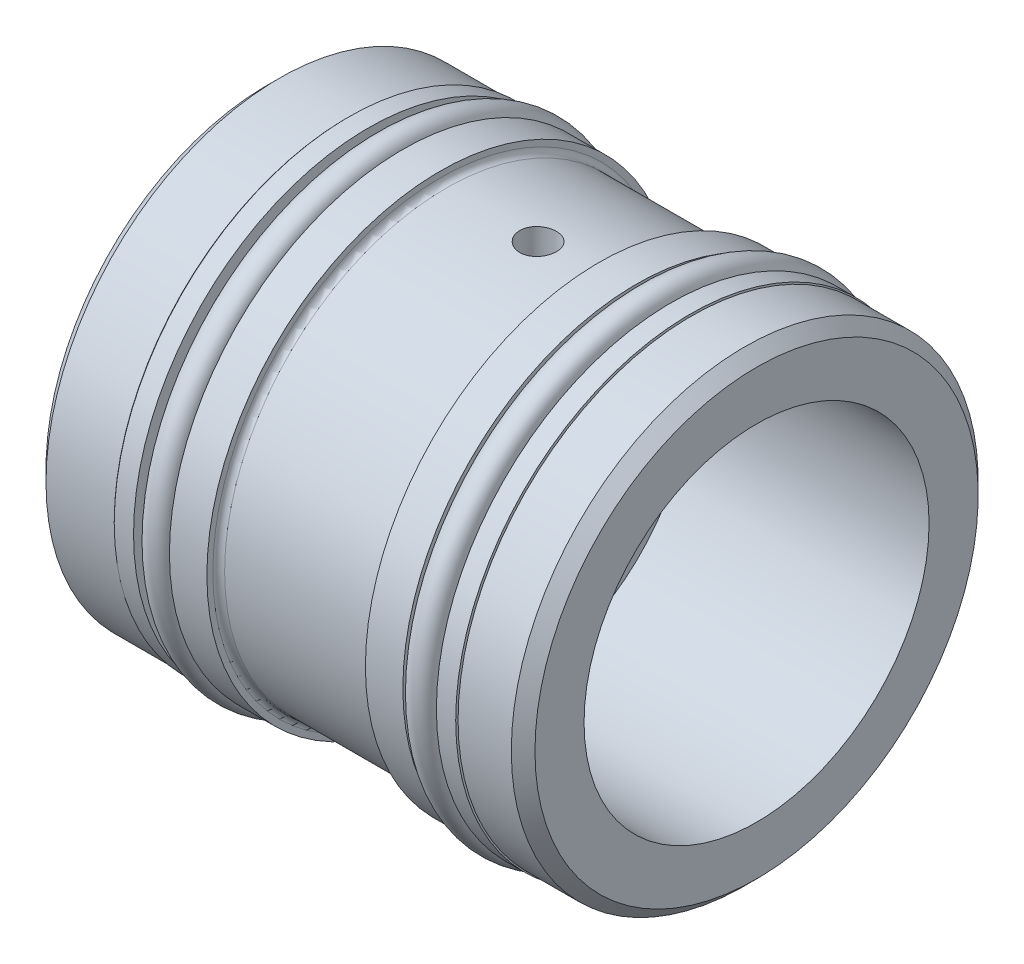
ISO-10303-21;
HEADER;
FILE_DESCRIPTION(('STEP AP214'),'2;1');
FILE_NAME('part.step','',(''),(''),'','','');
FILE_SCHEMA(('AUTOMOTIVE_DESIGN { 1 0 10303 214 1 1 1 1 }'));
ENDSEC;
DATA;
#1=APPLICATION_CONTEXT('core data for automotive mechanical design processes');
#2=APPLICATION_PROTOCOL_DEFINITION('international standard','automotive_design',2000,#1);
#3=PRODUCT_CONTEXT('',#1,'mechanical');
#4=PRODUCT('Part','Part','',(#3));
#5=PRODUCT_RELATED_PRODUCT_CATEGORY('part','',(#4));
#6=PRODUCT_DEFINITION_FORMATION('','',#4);
#7=PRODUCT_DEFINITION_CONTEXT('part definition',#1,'design');
#8=PRODUCT_DEFINITION('design','',#6,#7);
#9=PRODUCT_DEFINITION_SHAPE('','',#8);
#10=(LENGTH_UNIT() NAMED_UNIT(*) SI_UNIT(.MILLI.,.METRE.));
#11=(NAMED_UNIT(*) PLANE_ANGLE_UNIT() SI_UNIT($,.RADIAN.));
#12=(NAMED_UNIT(*) SI_UNIT($,.STERADIAN.) SOLID_ANGLE_UNIT());
#13=UNCERTAINTY_MEASURE_WITH_UNIT(LENGTH_MEASURE(1.E-05),#10,'distance_accuracy_value','');
#14=(GEOMETRIC_REPRESENTATION_CONTEXT(3) GLOBAL_UNCERTAINTY_ASSIGNED_CONTEXT((#13)) GLOBAL_UNIT_ASSIGNED_CONTEXT((#10,
#11,#12)) REPRESENTATION_CONTEXT('',''));
#15=CARTESIAN_POINT('',(0.,0.,0.));
#16=DIRECTION('',(0.,0.,1.));
#17=DIRECTION('',(1.,0.,0.));
#18=AXIS2_PLACEMENT_3D('',#15,#16,#17);
#19=CARTESIAN_POINT('',(0.,0.,0.));
#20=DIRECTION('',(-1.,0.,0.));
#21=DIRECTION('',(0.,0.,1.));
#22=AXIS2_PLACEMENT_3D('',#19,#20,#21);
#23=CYLINDRICAL_SURFACE('',#22,13.7668);
#24=CARTESIAN_POINT('',(9.32630715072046,0.,0.));
#25=DIRECTION('',(-1.,0.,0.));
#26=DIRECTION('',(0.,0.,1.));
#27=AXIS2_PLACEMENT_3D('',#24,#25,#26);
#28=CIRCLE('',#27,13.7668);
#29=CARTESIAN_POINT('',(9.32630715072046,0.,13.7668));
#30=VERTEX_POINT('',#29);
#31=EDGE_CURVE('E147',#30,#30,#28,.T.);
#32=ORIENTED_EDGE('',*,*,#31,.F.);
#33=EDGE_LOOP('',(#32));
#34=FACE_BOUND('',#33,.T.);
#35=CARTESIAN_POINT('',(10.2362,0.,0.));
#36=DIRECTION('',(1.,0.,0.));
#37=DIRECTION('',(0.,0.,-1.));
#38=AXIS2_PLACEMENT_3D('',#35,#36,#37);
#39=CIRCLE('',#38,13.7668);
#40=CARTESIAN_POINT('',(10.2362,0.,-13.7668));
#41=VERTEX_POINT('',#40);
#42=EDGE_CURVE('E10',#41,#41,#39,.T.);
#43=ORIENTED_EDGE('',*,*,#42,.F.);
#44=EDGE_LOOP('',(#43));
#45=FACE_BOUND('',#44,.T.);
#46=ADVANCED_FACE('F32',(#34,#45),#23,.T.);
#47=CARTESIAN_POINT('',(11.557,0.,0.));
#48=DIRECTION('',(-1.,0.,0.));
#49=DIRECTION('',(0.,0.,1.));
#50=AXIS2_PLACEMENT_3D('',#47,#48,#49);
#51=CIRCLE('',#50,13.7668);
#52=CARTESIAN_POINT('',(11.557,0.,13.7668));
#53=VERTEX_POINT('',#52);
#54=EDGE_CURVE('E199',#53,#53,#51,.T.);
#55=ORIENTED_EDGE('',*,*,#54,.T.);
#56=EDGE_LOOP('',(#55));
#57=FACE_BOUND('',#56,.T.);
#58=CARTESIAN_POINT('',(11.4808,0.,0.));
#59=DIRECTION('',(-1.,0.,0.));
#60=DIRECTION('',(0.,0.,1.));
#61=AXIS2_PLACEMENT_3D('',#58,#59,#60);
#62=CIRCLE('',#61,13.7668);
#63=CARTESIAN_POINT('',(11.4808,0.,13.7668));
#64=VERTEX_POINT('',#63);
#65=EDGE_CURVE('E44',#64,#64,#62,.T.);
#66=ORIENTED_EDGE('',*,*,#65,.F.);
#67=EDGE_LOOP('',(#66));
#68=FACE_BOUND('',#67,.T.);
#69=ADVANCED_FACE('F119',(#57,#68),#23,.T.);
#70=CARTESIAN_POINT('',(8.001,0.,0.));
#71=DIRECTION('',(-1.,0.,0.));
#72=DIRECTION('',(0.,0.,1.));
#73=AXIS2_PLACEMENT_3D('',#70,#71,#72);
#74=CIRCLE('',#73,13.7668);
#75=CARTESIAN_POINT('',(8.001,0.,13.7668));
#76=VERTEX_POINT('',#75);
#77=EDGE_CURVE('E143',#76,#76,#74,.T.);
#78=ORIENTED_EDGE('',*,*,#77,.F.);
#79=EDGE_LOOP('',(#78));
#80=FACE_BOUND('',#79,.T.);
#81=CARTESIAN_POINT('',(8.60609284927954,0.,0.));
#82=DIRECTION('',(1.,0.,0.));
#83=DIRECTION('',(0.,0.,-1.));
#84=AXIS2_PLACEMENT_3D('',#81,#82,#83);
#85=CIRCLE('',#84,13.7668);
#86=CARTESIAN_POINT('',(8.60609284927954,0.,-13.7668));
#87=VERTEX_POINT('',#86);
#88=EDGE_CURVE('E49',#87,#87,#85,.T.);
#89=ORIENTED_EDGE('',*,*,#88,.F.);
#90=EDGE_LOOP('',(#89));
#91=FACE_BOUND('',#90,.T.);
#92=ADVANCED_FACE('F122',(#80,#91),#23,.T.);
#93=CARTESIAN_POINT('',(0.,0.,0.));
#94=DIRECTION('',(-1.,0.,0.));
#95=DIRECTION('',(0.,0.,1.));
#96=AXIS2_PLACEMENT_3D('',#93,#94,#95);
#97=CYLINDRICAL_SURFACE('',#96,13.7668);
#98=CARTESIAN_POINT('',(-9.271,0.,0.));
#99=DIRECTION('',(-1.,0.,0.));
#100=DIRECTION('',(0.,0.,1.));
#101=AXIS2_PLACEMENT_3D('',#98,#99,#100);
#102=CIRCLE('',#101,13.7668);
#103=CARTESIAN_POINT('',(-9.271,0.,13.7668));
#104=VERTEX_POINT('',#103);
#105=EDGE_CURVE('E160',#104,#104,#102,.T.);
#106=ORIENTED_EDGE('',*,*,#105,.F.);
#107=EDGE_LOOP('',(#106));
#108=FACE_BOUND('',#107,.T.);
#109=CARTESIAN_POINT('',(-8.36110715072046,0.,0.));
#110=DIRECTION('',(1.,0.,0.));
#111=DIRECTION('',(0.,0.,-1.));
#112=AXIS2_PLACEMENT_3D('',#109,#110,#111);
#113=CIRCLE('',#112,13.7668);
#114=CARTESIAN_POINT('',(-8.36110715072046,0.,-13.7668));
#115=VERTEX_POINT('',#114);
#116=EDGE_CURVE('E149',#115,#115,#113,.T.);
#117=ORIENTED_EDGE('',*,*,#116,.F.);
#118=EDGE_LOOP('',(#117));
#119=FACE_BOUND('',#118,.T.);
#120=ADVANCED_FACE('F132',(#108,#119),#97,.T.);
#121=CARTESIAN_POINT('',(-7.0358,0.,0.));
#122=DIRECTION('',(-1.,0.,0.));
#123=DIRECTION('',(0.,0.,1.));
#124=AXIS2_PLACEMENT_3D('',#121,#122,#123);
#125=CIRCLE('',#124,13.7668);
#126=CARTESIAN_POINT('',(-7.0358,0.,13.7668));
#127=VERTEX_POINT('',#126);
#128=EDGE_CURVE('E215',#127,#127,#125,.T.);
#129=ORIENTED_EDGE('',*,*,#128,.T.);
#130=EDGE_LOOP('',(#129));
#131=FACE_BOUND('',#130,.T.);
#132=CARTESIAN_POINT('',(-7.64089284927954,0.,0.));
#133=DIRECTION('',(-1.,0.,0.));
#134=DIRECTION('',(0.,0.,1.));
#135=AXIS2_PLACEMENT_3D('',#132,#133,#134);
#136=CIRCLE('',#135,13.7668);
#137=CARTESIAN_POINT('',(-7.64089284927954,0.,13.7668));
#138=VERTEX_POINT('',#137);
#139=EDGE_CURVE('E154',#138,#138,#136,.T.);
#140=ORIENTED_EDGE('',*,*,#139,.F.);
#141=EDGE_LOOP('',(#140));
#142=FACE_BOUND('',#141,.T.);
#143=ADVANCED_FACE('F137',(#131,#142),#97,.T.);
#144=CARTESIAN_POINT('',(-10.5918,0.,0.));
#145=DIRECTION('',(-1.,0.,0.));
#146=DIRECTION('',(0.,0.,1.));
#147=AXIS2_PLACEMENT_3D('',#144,#145,#146);
#148=CIRCLE('',#147,13.7668);
#149=CARTESIAN_POINT('',(-10.5918,0.,13.7668));
#150=VERTEX_POINT('',#149);
#151=EDGE_CURVE('E218',#150,#150,#148,.T.);
#152=ORIENTED_EDGE('',*,*,#151,.F.);
#153=EDGE_LOOP('',(#152));
#154=FACE_BOUND('',#153,.T.);
#155=CARTESIAN_POINT('',(-10.5156,0.,0.));
#156=DIRECTION('',(1.,0.,0.));
#157=DIRECTION('',(0.,0.,-1.));
#158=AXIS2_PLACEMENT_3D('',#155,#156,#157);
#159=CIRCLE('',#158,13.7668);
#160=CARTESIAN_POINT('',(-10.5156,0.,-13.7668));
#161=VERTEX_POINT('',#160);
#162=EDGE_CURVE('E157',#161,#161,#159,.T.);
#163=ORIENTED_EDGE('',*,*,#162,.F.);
#164=EDGE_LOOP('',(#163));
#165=FACE_BOUND('',#164,.T.);
#166=ADVANCED_FACE('F98',(#154,#165),#97,.T.);
#167=CARTESIAN_POINT('',(0.,0.,0.));
#168=DIRECTION('',(-1.,0.,0.));
#169=DIRECTION('',(0.,0.,1.));
#170=AXIS2_PLACEMENT_3D('',#167,#168,#169);
#171=CYLINDRICAL_SURFACE('',#170,6.35);
#172=CARTESIAN_POINT('',(0.355599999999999,0.,0.));
#173=DIRECTION('',(-1.,0.,0.));
#174=DIRECTION('',(0.,0.,1.));
#175=AXIS2_PLACEMENT_3D('',#172,#173,#174);
#176=CIRCLE('',#175,6.35);
#177=CARTESIAN_POINT('',(0.355599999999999,0.,6.35));
#178=VERTEX_POINT('',#177);
#179=EDGE_CURVE('E187',#178,#178,#176,.T.);
#180=ORIENTED_EDGE('',*,*,#179,.F.);
#181=EDGE_LOOP('',(#180));
#182=FACE_BOUND('',#181,.T.);
#183=CARTESIAN_POINT('',(-15.748,0.,0.));
#184=DIRECTION('',(-1.,0.,0.));
#185=DIRECTION('',(0.,0.,1.));
#186=AXIS2_PLACEMENT_3D('',#183,#184,#185);
#187=CIRCLE('',#186,6.35);
#188=CARTESIAN_POINT('',(-15.748,0.,6.35));
#189=VERTEX_POINT('',#188);
#190=EDGE_CURVE('E224',#189,#189,#187,.T.);
#191=ORIENTED_EDGE('',*,*,#190,.T.);
#192=EDGE_LOOP('',(#191));
#193=FACE_BOUND('',#192,.T.);
#194=ADVANCED_FACE('F94',(#182,#193),#171,.F.);
#195=CARTESIAN_POINT('',(0.355599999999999,6.35,0.));
#196=DIRECTION('',(-1.,0.,0.));
#197=DIRECTION('',(0.,0.,1.));
#198=AXIS2_PLACEMENT_3D('',#195,#196,#197);
#199=PLANE('',#198);
#200=CARTESIAN_POINT('',(0.355599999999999,0.,0.));
#201=DIRECTION('',(-1.,0.,0.));
#202=DIRECTION('',(0.,0.,1.));
#203=AXIS2_PLACEMENT_3D('',#200,#201,#202);
#204=CIRCLE('',#203,11.1125);
#205=CARTESIAN_POINT('',(0.355599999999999,0.,11.1125));
#206=VERTEX_POINT('',#205);
#207=EDGE_CURVE('E190',#206,#206,#204,.T.);
#208=ORIENTED_EDGE('',*,*,#207,.F.);
#209=EDGE_LOOP('',(#208));
#210=FACE_BOUND('',#209,.T.);
#211=ORIENTED_EDGE('',*,*,#179,.T.);
#212=EDGE_LOOP('',(#211));
#213=FACE_BOUND('',#212,.T.);
#214=ADVANCED_FACE('F88',(#210,#213),#199,.F.);
#215=CARTESIAN_POINT('',(0.,0.,0.));
#216=DIRECTION('',(-1.,0.,0.));
#217=DIRECTION('',(0.,0.,1.));
#218=AXIS2_PLACEMENT_3D('',#215,#216,#217);
#219=CYLINDRICAL_SURFACE('',#218,11.1125);
#220=CARTESIAN_POINT('',(1.6764,-11.0495546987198,1.1811));
#221=CARTESIAN_POINT('',(1.61025843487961,-11.0495555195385,1.18109714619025));
#222=CARTESIAN_POINT('',(1.5440736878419,-11.0501549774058,1.17552539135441));
#223=CARTESIAN_POINT('',(1.4135407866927,-11.0524875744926,1.15338363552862));
#224=CARTESIAN_POINT('',(1.34919471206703,-11.054221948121,1.13680165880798));
#225=CARTESIAN_POINT('',(1.22424827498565,-11.0586257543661,1.09312916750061));
#226=CARTESIAN_POINT('',(1.16364560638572,-11.0612946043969,1.06604519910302));
#227=CARTESIAN_POINT('',(1.04785884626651,-11.0672659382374,1.00215046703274));
#228=CARTESIAN_POINT('',(0.992673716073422,-11.0705683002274,0.965341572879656));
#229=CARTESIAN_POINT('',(0.889050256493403,-11.0774496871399,0.882880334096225));
#230=CARTESIAN_POINT('',(0.840637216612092,-11.0810296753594,0.837196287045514));
#231=CARTESIAN_POINT('',(0.752150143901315,-11.0880542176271,0.73834944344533));
#232=CARTESIAN_POINT('',(0.712076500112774,-11.0914987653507,0.685186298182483));
#233=CARTESIAN_POINT('',(0.641317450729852,-11.097873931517,0.57273433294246));
#234=CARTESIAN_POINT('',(0.610654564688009,-11.1008033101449,0.5134312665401));
#235=CARTESIAN_POINT('',(0.559731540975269,-11.105807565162,0.39048157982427));
#236=CARTESIAN_POINT('',(0.53947111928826,-11.1078824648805,0.326835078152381));
#237=CARTESIAN_POINT('',(0.510002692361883,-11.1109372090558,0.197261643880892));
#238=CARTESIAN_POINT('',(0.500753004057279,-11.1119211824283,0.131344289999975));
#239=CARTESIAN_POINT('',(0.493439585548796,-11.11269726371,-0.00111401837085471));
#240=CARTESIAN_POINT('',(0.495375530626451,-11.1124894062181,-0.0676549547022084));
#241=CARTESIAN_POINT('',(0.510344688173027,-11.1109086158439,-0.199188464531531));
#242=CARTESIAN_POINT('',(0.523333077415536,-11.1095403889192,-0.264186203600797));
#243=CARTESIAN_POINT('',(0.559968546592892,-11.1057979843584,-0.391074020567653));
#244=CARTESIAN_POINT('',(0.583615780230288,-11.1034237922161,-0.45296405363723));
#245=CARTESIAN_POINT('',(0.640946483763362,-11.0979282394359,-0.572020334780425));
#246=CARTESIAN_POINT('',(0.674649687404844,-11.0948054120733,-0.629177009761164));
#247=CARTESIAN_POINT('',(0.751121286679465,-11.088162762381,-0.73703965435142));
#248=CARTESIAN_POINT('',(0.793889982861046,-11.0846429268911,-0.787745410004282));
#249=CARTESIAN_POINT('',(0.887530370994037,-11.0775804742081,-0.881529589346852));
#250=CARTESIAN_POINT('',(0.938441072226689,-11.0740378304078,-0.924569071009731));
#251=CARTESIAN_POINT('',(1.04678534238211,-11.0673463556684,-1.00149721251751));
#252=CARTESIAN_POINT('',(1.10421892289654,-11.0641975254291,-1.0353858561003));
#253=CARTESIAN_POINT('',(1.22400964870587,-11.0586500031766,-1.09305071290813));
#254=CARTESIAN_POINT('',(1.28636804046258,-11.0562515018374,-1.11682435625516));
#255=CARTESIAN_POINT('',(1.41422273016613,-11.0524801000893,-1.15355269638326));
#256=CARTESIAN_POINT('',(1.479718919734,-11.0511071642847,-1.16650776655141));
#257=CARTESIAN_POINT('',(1.61164766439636,-11.0495485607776,-1.1811807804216));
#258=CARTESIAN_POINT('',(1.67807408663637,-11.049357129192,-1.1829532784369));
#259=CARTESIAN_POINT('',(1.81027809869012,-11.0501679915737,-1.17535425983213));
#260=CARTESIAN_POINT('',(1.87605569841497,-11.0511702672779,-1.16598291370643));
#261=CARTESIAN_POINT('',(2.00493483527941,-11.0542503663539,-1.13640793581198));
#262=CARTESIAN_POINT('',(2.0680423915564,-11.0563256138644,-1.11623024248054));
#263=CARTESIAN_POINT('',(2.18997742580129,-11.0613157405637,-1.0656418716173));
#264=CARTESIAN_POINT('',(2.248804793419,-11.0642306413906,-1.03523093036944));
#265=CARTESIAN_POINT('',(2.36075779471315,-11.07058556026,-0.964903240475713));
#266=CARTESIAN_POINT('',(2.41386065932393,-11.0740275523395,-0.924950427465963));
#267=CARTESIAN_POINT('',(2.51262603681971,-11.0810424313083,-0.836724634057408));
#268=CARTESIAN_POINT('',(2.55828834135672,-11.0846153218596,-0.788451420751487));
#269=CARTESIAN_POINT('',(2.64106535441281,-11.091506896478,-0.684718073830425));
#270=CARTESIAN_POINT('',(2.67814441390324,-11.0948244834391,-0.629229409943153));
#271=CARTESIAN_POINT('',(2.74245677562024,-11.1008155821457,-0.512780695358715));
#272=CARTESIAN_POINT('',(2.7696902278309,-11.1034891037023,-0.451820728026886));
#273=CARTESIAN_POINT('',(2.81347826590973,-11.1078859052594,-0.326282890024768));
#274=CARTESIAN_POINT('',(2.83005416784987,-11.1096110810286,-0.261712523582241));
#275=CARTESIAN_POINT('',(2.8521260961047,-11.1119246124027,-0.130685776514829));
#276=CARTESIAN_POINT('',(2.8576224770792,-11.1125130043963,-0.0642294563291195));
#277=CARTESIAN_POINT('',(2.85737398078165,-11.1124866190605,0.068333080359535));
#278=CARTESIAN_POINT('',(2.85168435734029,-11.1118777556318,0.134439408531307));
#279=CARTESIAN_POINT('',(2.82934149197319,-11.1095369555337,0.264751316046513));
#280=CARTESIAN_POINT('',(2.81268824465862,-11.1078050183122,0.328956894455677));
#281=CARTESIAN_POINT('',(2.76890665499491,-11.1034120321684,0.453642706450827));
#282=CARTESIAN_POINT('',(2.7417801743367,-11.1007511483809,0.514123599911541));
#283=CARTESIAN_POINT('',(2.6778279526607,-11.0947964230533,0.62968276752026));
#284=CARTESIAN_POINT('',(2.64100222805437,-11.0915025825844,0.684761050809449));
#285=CARTESIAN_POINT('',(2.55849016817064,-11.0846311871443,0.788234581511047));
#286=CARTESIAN_POINT('',(2.51276266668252,-11.0810523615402,0.836596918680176));
#287=CARTESIAN_POINT('',(2.41382775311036,-11.0740249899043,0.924985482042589));
#288=CARTESIAN_POINT('',(2.36061855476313,-11.0705764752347,0.96500971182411));
#289=CARTESIAN_POINT('',(2.24806302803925,-11.0641897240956,1.03567775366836));
#290=CARTESIAN_POINT('',(2.18869971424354,-11.0612529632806,1.06629462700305));
#291=CARTESIAN_POINT('',(2.06568010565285,-11.0562397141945,1.11708410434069));
#292=CARTESIAN_POINT('',(2.00202870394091,-11.054162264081,1.13726839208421));
#293=CARTESIAN_POINT('',(1.89441976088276,-11.051622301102,1.16163240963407));
#294=CARTESIAN_POINT('',(1.85114823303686,-11.0508506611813,1.16892266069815));
#295=CARTESIAN_POINT('',(1.76405745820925,-11.0498165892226,1.17865738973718));
#296=CARTESIAN_POINT('',(1.7202382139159,-11.0495541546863,1.18110189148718));
#297=CARTESIAN_POINT('',(1.6764,-11.0495546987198,1.1811));
#298=B_SPLINE_CURVE_WITH_KNOTS('',3,(#220,#221,#222,#223,#224,#225,#226,#227,#228,#229,#230,
#231,#232,#233,#234,#235,#236,#237,#238,#239,#240,#241,#242,#243,#244,#245,#246,#247,#248,#249,
#250,#251,#252,#253,#254,#255,#256,#257,#258,#259,#260,#261,#262,#263,#264,#265,#266,#267,#268,
#269,#270,#271,#272,#273,#274,#275,#276,#277,#278,#279,#280,#281,#282,#283,#284,#285,#286,#287,
#288,#289,#290,#291,#292,#293,#294,#295,#296,#297),.UNSPECIFIED.,.T.,.F.,(4,2,2,2,2,2,2,2,2,2,2,
2,2,2,2,2,2,2,2,2,2,2,2,2,2,2,2,2,2,2,2,2,2,2,2,2,2,2,4),(0.,0.198264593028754,
0.396745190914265,0.595102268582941,0.793421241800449,0.99246209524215,1.19151223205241,
1.39103503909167,1.59055239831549,1.78931202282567,1.98806587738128,2.18601750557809,
2.38397198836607,2.58231751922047,2.78066962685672,2.98000221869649,3.17933516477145,
3.37871872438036,3.57809540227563,3.77649866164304,3.97489888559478,4.17282501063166,
4.37075623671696,4.5694477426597,4.76814481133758,4.96765289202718,5.16715793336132,
5.36626269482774,5.56536108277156,5.76347848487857,5.96159598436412,6.15967828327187,
6.35776024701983,6.55678098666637,6.75584932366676,6.95548250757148,7.15489162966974,
7.28630080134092,7.41770932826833),.UNSPECIFIED.);
#299=CARTESIAN_POINT('',(1.6764,-11.0495546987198,1.1811));
#300=VERTEX_POINT('',#299);
#301=EDGE_CURVE('E78',#300,#300,#298,.T.);
#302=ORIENTED_EDGE('',*,*,#301,.T.);
#303=EDGE_LOOP('',(#302));
#304=FACE_BOUND('',#303,.T.);
#305=CARTESIAN_POINT('',(1.6764,11.0495546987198,1.1811));
#306=CARTESIAN_POINT('',(1.74254156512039,11.0495555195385,1.18109714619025));
#307=CARTESIAN_POINT('',(1.80872631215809,11.0501549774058,1.17552539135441));
#308=CARTESIAN_POINT('',(1.9392592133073,11.0524875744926,1.15338363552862));
#309=CARTESIAN_POINT('',(2.00360528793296,11.054221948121,1.13680165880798));
#310=CARTESIAN_POINT('',(2.12855172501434,11.0586257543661,1.09312916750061));
#311=CARTESIAN_POINT('',(2.18915439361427,11.0612946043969,1.06604519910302));
#312=CARTESIAN_POINT('',(2.30494115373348,11.0672659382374,1.00215046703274));
#313=CARTESIAN_POINT('',(2.36012628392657,11.0705683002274,0.965341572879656));
#314=CARTESIAN_POINT('',(2.46374974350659,11.0774496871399,0.882880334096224));
#315=CARTESIAN_POINT('',(2.5121627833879,11.0810296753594,0.837196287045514));
#316=CARTESIAN_POINT('',(2.60064985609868,11.0880542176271,0.73834944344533));
#317=CARTESIAN_POINT('',(2.64072349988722,11.0914987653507,0.685186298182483));
#318=CARTESIAN_POINT('',(2.71148254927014,11.097873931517,0.57273433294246));
#319=CARTESIAN_POINT('',(2.74214543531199,11.1008033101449,0.5134312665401));
#320=CARTESIAN_POINT('',(2.79306845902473,11.105807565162,0.39048157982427));
#321=CARTESIAN_POINT('',(2.81332888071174,11.1078824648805,0.326835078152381));
#322=CARTESIAN_POINT('',(2.84279730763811,11.1109372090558,0.197261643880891));
#323=CARTESIAN_POINT('',(2.85204699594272,11.1119211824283,0.131344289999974));
#324=CARTESIAN_POINT('',(2.8593604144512,11.11269726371,-0.00111401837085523));
#325=CARTESIAN_POINT('',(2.85742446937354,11.1124894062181,-0.0676549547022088));
#326=CARTESIAN_POINT('',(2.84245531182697,11.1109086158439,-0.199188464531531));
#327=CARTESIAN_POINT('',(2.82946692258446,11.1095403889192,-0.264186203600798));
#328=CARTESIAN_POINT('',(2.7928314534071,11.1057979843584,-0.391074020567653));
#329=CARTESIAN_POINT('',(2.76918421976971,11.1034237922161,-0.452964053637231));
#330=CARTESIAN_POINT('',(2.71185351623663,11.0979282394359,-0.572020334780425));
#331=CARTESIAN_POINT('',(2.67815031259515,11.0948054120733,-0.629177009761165));
#332=CARTESIAN_POINT('',(2.60167871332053,11.088162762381,-0.737039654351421));
#333=CARTESIAN_POINT('',(2.55891001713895,11.0846429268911,-0.787745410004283));
#334=CARTESIAN_POINT('',(2.46526962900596,11.0775804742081,-0.881529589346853));
#335=CARTESIAN_POINT('',(2.41435892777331,11.0740378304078,-0.924569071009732));
#336=CARTESIAN_POINT('',(2.30601465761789,11.0673463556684,-1.00149721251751));
#337=CARTESIAN_POINT('',(2.24858107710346,11.0641975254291,-1.0353858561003));
#338=CARTESIAN_POINT('',(2.12879035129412,11.0586500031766,-1.09305071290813));
#339=CARTESIAN_POINT('',(2.06643195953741,11.0562515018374,-1.11682435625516));
#340=CARTESIAN_POINT('',(1.93857726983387,11.0524801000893,-1.15355269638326));
#341=CARTESIAN_POINT('',(1.87308108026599,11.0511071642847,-1.16650776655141));
#342=CARTESIAN_POINT('',(1.74115233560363,11.0495485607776,-1.1811807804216));
#343=CARTESIAN_POINT('',(1.67472591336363,11.049357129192,-1.1829532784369));
#344=CARTESIAN_POINT('',(1.54252190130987,11.0501679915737,-1.17535425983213));
#345=CARTESIAN_POINT('',(1.47674430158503,11.0511702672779,-1.16598291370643));
#346=CARTESIAN_POINT('',(1.34786516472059,11.0542503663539,-1.13640793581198));
#347=CARTESIAN_POINT('',(1.28475760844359,11.0563256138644,-1.11623024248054));
#348=CARTESIAN_POINT('',(1.16282257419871,11.0613157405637,-1.0656418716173));
#349=CARTESIAN_POINT('',(1.10399520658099,11.0642306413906,-1.03523093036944));
#350=CARTESIAN_POINT('',(0.992042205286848,11.07058556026,-0.964903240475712));
#351=CARTESIAN_POINT('',(0.93893934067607,11.0740275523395,-0.924950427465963));
#352=CARTESIAN_POINT('',(0.840173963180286,11.0810424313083,-0.836724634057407));
#353=CARTESIAN_POINT('',(0.794511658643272,11.0846153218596,-0.788451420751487));
#354=CARTESIAN_POINT('',(0.711734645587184,11.091506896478,-0.684718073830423));
#355=CARTESIAN_POINT('',(0.674655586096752,11.0948244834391,-0.629229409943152));
#356=CARTESIAN_POINT('',(0.610343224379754,11.1008155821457,-0.512780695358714));
#357=CARTESIAN_POINT('',(0.583109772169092,11.1034891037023,-0.451820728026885));
#358=CARTESIAN_POINT('',(0.539321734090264,11.1078859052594,-0.326282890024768));
#359=CARTESIAN_POINT('',(0.522745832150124,11.1096110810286,-0.261712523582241));
#360=CARTESIAN_POINT('',(0.500673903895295,11.1119246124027,-0.130685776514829));
#361=CARTESIAN_POINT('',(0.4951775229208,11.1125130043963,-0.0642294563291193));
#362=CARTESIAN_POINT('',(0.495426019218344,11.1124866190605,0.0683330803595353));
#363=CARTESIAN_POINT('',(0.501115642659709,11.1118777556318,0.134439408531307));
#364=CARTESIAN_POINT('',(0.523458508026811,11.1095369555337,0.264751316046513));
#365=CARTESIAN_POINT('',(0.540111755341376,11.1078050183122,0.328956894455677));
#366=CARTESIAN_POINT('',(0.583893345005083,11.1034120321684,0.453642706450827));
#367=CARTESIAN_POINT('',(0.611019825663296,11.1007511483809,0.514123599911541));
#368=CARTESIAN_POINT('',(0.674972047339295,11.0947964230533,0.629682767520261));
#369=CARTESIAN_POINT('',(0.711797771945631,11.0915025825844,0.684761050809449));
#370=CARTESIAN_POINT('',(0.794309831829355,11.0846311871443,0.788234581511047));
#371=CARTESIAN_POINT('',(0.840037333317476,11.0810523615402,0.836596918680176));
#372=CARTESIAN_POINT('',(0.938972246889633,11.0740249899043,0.924985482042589));
#373=CARTESIAN_POINT('',(0.992181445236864,11.0705764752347,0.96500971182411));
#374=CARTESIAN_POINT('',(1.10473697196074,11.0641897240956,1.03567775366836));
#375=CARTESIAN_POINT('',(1.16410028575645,11.0612529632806,1.06629462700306));
#376=CARTESIAN_POINT('',(1.28711989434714,11.0562397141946,1.11708410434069));
#377=CARTESIAN_POINT('',(1.35077129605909,11.054162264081,1.13726839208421));
#378=CARTESIAN_POINT('',(1.45838023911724,11.051622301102,1.16163240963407));
#379=CARTESIAN_POINT('',(1.50165176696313,11.0508506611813,1.16892266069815));
#380=CARTESIAN_POINT('',(1.58874254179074,11.0498165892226,1.17865738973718));
#381=CARTESIAN_POINT('',(1.6325617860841,11.0495541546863,1.18110189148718));
#382=CARTESIAN_POINT('',(1.6764,11.0495546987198,1.1811));
#383=B_SPLINE_CURVE_WITH_KNOTS('',3,(#305,#306,#307,#308,#309,#310,#311,#312,#313,#314,#315,
#316,#317,#318,#319,#320,#321,#322,#323,#324,#325,#326,#327,#328,#329,#330,#331,#332,#333,#334,
#335,#336,#337,#338,#339,#340,#341,#342,#343,#344,#345,#346,#347,#348,#349,#350,#351,#352,#353,
#354,#355,#356,#357,#358,#359,#360,#361,#362,#363,#364,#365,#366,#367,#368,#369,#370,#371,#372,
#373,#374,#375,#376,#377,#378,#379,#380,#381,#382),.UNSPECIFIED.,.T.,.F.,(4,2,2,2,2,2,2,2,2,2,2,
2,2,2,2,2,2,2,2,2,2,2,2,2,2,2,2,2,2,2,2,2,2,2,2,2,2,2,4),(0.,0.198264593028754,
0.396745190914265,0.595102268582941,0.793421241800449,0.992462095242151,1.19151223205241,
1.39103503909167,1.59055239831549,1.78931202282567,1.98806587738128,2.18601750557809,
2.38397198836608,2.58231751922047,2.78066962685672,2.98000221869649,3.17933516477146,
3.37871872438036,3.57809540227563,3.77649866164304,3.97489888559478,4.17282501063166,
4.37075623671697,4.5694477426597,4.76814481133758,4.96765289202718,5.16715793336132,
5.36626269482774,5.56536108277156,5.76347848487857,5.96159598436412,6.15967828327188,
6.35776024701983,6.55678098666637,6.75584932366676,6.95548250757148,7.15489162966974,
7.28630080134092,7.41770932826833),.UNSPECIFIED.);
#384=CARTESIAN_POINT('',(1.6764,11.0495546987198,1.1811));
#385=VERTEX_POINT('',#384);
#386=EDGE_CURVE('E73',#385,#385,#383,.T.);
#387=ORIENTED_EDGE('',*,*,#386,.T.);
#388=EDGE_LOOP('',(#387));
#389=FACE_BOUND('',#388,.T.);
#390=CARTESIAN_POINT('',(15.748,0.,0.));
#391=DIRECTION('',(-1.,0.,0.));
#392=DIRECTION('',(0.,0.,1.));
#393=AXIS2_PLACEMENT_3D('',#390,#391,#392);
#394=CIRCLE('',#393,11.1125);
#395=CARTESIAN_POINT('',(15.748,0.,11.1125));
#396=VERTEX_POINT('',#395);
#397=EDGE_CURVE('E193',#396,#396,#394,.T.);
#398=ORIENTED_EDGE('',*,*,#397,.F.);
#399=EDGE_LOOP('',(#398));
#400=FACE_BOUND('',#399,.T.);
#401=ORIENTED_EDGE('',*,*,#207,.T.);
#402=EDGE_LOOP('',(#401));
#403=FACE_BOUND('',#402,.T.);
#404=ADVANCED_FACE('F82',(#304,#389,#400,#403),#219,.F.);
#405=CARTESIAN_POINT('',(15.748,15.0368,0.));
#406=DIRECTION('',(-1.,0.,0.));
#407=DIRECTION('',(0.,0.,1.));
#408=AXIS2_PLACEMENT_3D('',#405,#406,#407);
#409=PLANE('',#408);
#410=CARTESIAN_POINT('',(15.748,0.,0.));
#411=DIRECTION('',(-1.,0.,0.));
#412=DIRECTION('',(0.,0.,1.));
#413=AXIS2_PLACEMENT_3D('',#410,#411,#412);
#414=CIRCLE('',#413,14.2748);
#415=CARTESIAN_POINT('',(15.748,0.,14.2748));
#416=VERTEX_POINT('',#415);
#417=EDGE_CURVE('E169',#416,#416,#414,.F.);
#418=ORIENTED_EDGE('',*,*,#417,.T.);
#419=EDGE_LOOP('',(#418));
#420=FACE_BOUND('',#419,.T.);
#421=ORIENTED_EDGE('',*,*,#397,.T.);
#422=EDGE_LOOP('',(#421));
#423=FACE_BOUND('',#422,.T.);
#424=ADVANCED_FACE('F87',(#420,#423),#409,.F.);
#425=CARTESIAN_POINT('',(0.,0.,0.));
#426=DIRECTION('',(-1.,0.,0.));
#427=DIRECTION('',(0.,0.,1.));
#428=AXIS2_PLACEMENT_3D('',#425,#426,#427);
#429=CYLINDRICAL_SURFACE('',#428,15.0368);
#430=CARTESIAN_POINT('',(14.986,0.,0.));
#431=DIRECTION('',(-1.,0.,0.));
#432=DIRECTION('',(0.,0.,1.));
#433=AXIS2_PLACEMENT_3D('',#430,#431,#432);
#434=CIRCLE('',#433,15.0368);
#435=CARTESIAN_POINT('',(14.986,0.,15.0368));
#436=VERTEX_POINT('',#435);
#437=EDGE_CURVE('E172',#436,#436,#434,.T.);
#438=ORIENTED_EDGE('',*,*,#437,.T.);
#439=EDGE_LOOP('',(#438));
#440=FACE_BOUND('',#439,.T.);
#441=CARTESIAN_POINT('',(11.557,0.,0.));
#442=DIRECTION('',(-1.,0.,0.));
#443=DIRECTION('',(0.,0.,1.));
#444=AXIS2_PLACEMENT_3D('',#441,#442,#443);
#445=CIRCLE('',#444,15.0368);
#446=CARTESIAN_POINT('',(11.557,0.,15.0368));
#447=VERTEX_POINT('',#446);
#448=EDGE_CURVE('E196',#447,#447,#445,.T.);
#449=ORIENTED_EDGE('',*,*,#448,.F.);
#450=EDGE_LOOP('',(#449));
#451=FACE_BOUND('',#450,.T.);
#452=ADVANCED_FACE('F419',(#440,#451),#429,.T.);
#453=CARTESIAN_POINT('',(11.557,15.0368,0.));
#454=DIRECTION('',(1.,0.,0.));
#455=DIRECTION('',(0.,0.,-1.));
#456=AXIS2_PLACEMENT_3D('',#453,#454,#455);
#457=PLANE('',#456);
#458=ORIENTED_EDGE('',*,*,#54,.F.);
#459=EDGE_LOOP('',(#458));
#460=FACE_BOUND('',#459,.T.);
#461=ORIENTED_EDGE('',*,*,#448,.T.);
#462=EDGE_LOOP('',(#461));
#463=FACE_BOUND('',#462,.T.);
#464=ADVANCED_FACE('F427',(#460,#463),#457,.F.);
#465=CARTESIAN_POINT('',(8.001,13.7668,0.));
#466=DIRECTION('',(-1.,0.,0.));
#467=DIRECTION('',(0.,0.,1.));
#468=AXIS2_PLACEMENT_3D('',#465,#466,#467);
#469=PLANE('',#468);
#470=CARTESIAN_POINT('',(8.001,0.,0.));
#471=DIRECTION('',(-1.,0.,0.));
#472=DIRECTION('',(0.,0.,1.));
#473=AXIS2_PLACEMENT_3D('',#470,#471,#472);
#474=CIRCLE('',#473,15.0368);
#475=CARTESIAN_POINT('',(8.001,0.,15.0368));
#476=VERTEX_POINT('',#475);
#477=EDGE_CURVE('E203',#476,#476,#474,.T.);
#478=ORIENTED_EDGE('',*,*,#477,.F.);
#479=EDGE_LOOP('',(#478));
#480=FACE_BOUND('',#479,.T.);
#481=ORIENTED_EDGE('',*,*,#77,.T.);
#482=EDGE_LOOP('',(#481));
#483=FACE_BOUND('',#482,.T.);
#484=ADVANCED_FACE('F434',(#480,#483),#469,.F.);
#485=CARTESIAN_POINT('',(0.,0.,0.));
#486=DIRECTION('',(-1.,0.,0.));
#487=DIRECTION('',(0.,0.,1.));
#488=AXIS2_PLACEMENT_3D('',#485,#486,#487);
#489=CYLINDRICAL_SURFACE('',#488,15.0368);
#490=CARTESIAN_POINT('',(5.588,0.,0.));
#491=DIRECTION('',(-1.,0.,0.));
#492=DIRECTION('',(0.,0.,1.));
#493=AXIS2_PLACEMENT_3D('',#490,#491,#492);
#494=CIRCLE('',#493,15.0368);
#495=CARTESIAN_POINT('',(5.588,0.,15.0368));
#496=VERTEX_POINT('',#495);
#497=EDGE_CURVE('E206',#496,#496,#494,.T.);
#498=ORIENTED_EDGE('',*,*,#497,.F.);
#499=EDGE_LOOP('',(#498));
#500=FACE_BOUND('',#499,.T.);
#501=ORIENTED_EDGE('',*,*,#477,.T.);
#502=EDGE_LOOP('',(#501));
#503=FACE_BOUND('',#502,.T.);
#504=ADVANCED_FACE('F294',(#500,#503),#489,.T.);
#505=CARTESIAN_POINT('',(5.588,15.0368,0.));
#506=DIRECTION('',(1.,0.,0.));
#507=DIRECTION('',(0.,0.,-1.));
#508=AXIS2_PLACEMENT_3D('',#505,#506,#507);
#509=PLANE('',#508);
#510=CARTESIAN_POINT('',(5.588,0.,0.));
#511=DIRECTION('',(1.,0.,0.));
#512=DIRECTION('',(0.,0.,-1.));
#513=AXIS2_PLACEMENT_3D('',#510,#511,#512);
#514=CIRCLE('',#513,14.6558);
#515=CARTESIAN_POINT('',(5.588,0.,-14.6558));
#516=VERTEX_POINT('',#515);
#517=EDGE_CURVE('E178',#516,#516,#514,.T.);
#518=ORIENTED_EDGE('',*,*,#517,.T.);
#519=EDGE_LOOP('',(#518));
#520=FACE_BOUND('',#519,.T.);
#521=ORIENTED_EDGE('',*,*,#497,.T.);
#522=EDGE_LOOP('',(#521));
#523=FACE_BOUND('',#522,.T.);
#524=ADVANCED_FACE('F284',(#520,#523),#509,.F.);
#525=CARTESIAN_POINT('',(0.,0.,0.));
#526=DIRECTION('',(-1.,0.,0.));
#527=DIRECTION('',(0.,0.,1.));
#528=AXIS2_PLACEMENT_3D('',#525,#526,#527);
#529=CYLINDRICAL_SURFACE('',#528,14.2748);
#530=CARTESIAN_POINT('',(1.6764,-14.2258538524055,1.1811));
#531=CARTESIAN_POINT('',(1.74262096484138,-14.2258545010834,1.18109710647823));
#532=CARTESIAN_POINT('',(1.80888705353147,-14.2263212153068,1.17551202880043));
#533=CARTESIAN_POINT('',(1.93958585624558,-14.2281376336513,1.1533142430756));
#534=CARTESIAN_POINT('',(2.00401640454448,-14.2294883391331,1.13668902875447));
#535=CARTESIAN_POINT('',(2.12913224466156,-14.2329187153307,1.09289497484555));
#536=CARTESIAN_POINT('',(2.18981963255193,-14.2349979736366,1.06573209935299));
#537=CARTESIAN_POINT('',(2.30575918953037,-14.2396506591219,1.00164435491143));
#538=CARTESIAN_POINT('',(2.36101251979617,-14.2422239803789,0.964721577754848));
#539=CARTESIAN_POINT('',(2.46466995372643,-14.2475821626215,0.882061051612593));
#540=CARTESIAN_POINT('',(2.51305839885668,-14.2503674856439,0.836303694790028));
#541=CARTESIAN_POINT('',(2.60147798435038,-14.2558316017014,0.737314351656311));
#542=CARTESIAN_POINT('',(2.64150876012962,-14.2585103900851,0.684082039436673));
#543=CARTESIAN_POINT('',(2.71212867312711,-14.2634639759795,0.571560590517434));
#544=CARTESIAN_POINT('',(2.74270427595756,-14.2657381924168,0.512262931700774));
#545=CARTESIAN_POINT('',(2.79345933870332,-14.2696214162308,0.389353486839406));
#546=CARTESIAN_POINT('',(2.8136389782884,-14.2712304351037,0.325741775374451));
#547=CARTESIAN_POINT('',(2.84298425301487,-14.2735987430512,0.196165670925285));
#548=CARTESIAN_POINT('',(2.8521752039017,-14.2743599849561,0.130207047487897));
#549=CARTESIAN_POINT('',(2.85936046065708,-14.2749535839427,-0.00232075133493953));
#550=CARTESIAN_POINT('',(2.85735497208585,-14.2747859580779,-0.0688899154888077));
#551=CARTESIAN_POINT('',(2.84222498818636,-14.2735423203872,-0.200577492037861));
#552=CARTESIAN_POINT('',(2.82912771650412,-14.2724685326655,-0.265699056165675));
#553=CARTESIAN_POINT('',(2.79222827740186,-14.2695359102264,-0.392816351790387));
#554=CARTESIAN_POINT('',(2.76842600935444,-14.2676770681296,-0.454812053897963));
#555=CARTESIAN_POINT('',(2.71076187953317,-14.2633796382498,-0.574004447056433));
#556=CARTESIAN_POINT('',(2.6768878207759,-14.2609403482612,-0.631195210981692));
#557=CARTESIAN_POINT('',(2.60005052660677,-14.2557561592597,-0.739089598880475));
#558=CARTESIAN_POINT('',(2.55708710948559,-14.2530112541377,-0.789793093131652));
#559=CARTESIAN_POINT('',(2.46313722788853,-14.2475146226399,-0.883432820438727));
#560=CARTESIAN_POINT('',(2.41212710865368,-14.2447629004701,-0.926345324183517));
#561=CARTESIAN_POINT('',(2.30361426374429,-14.2395710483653,-1.0030016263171));
#562=CARTESIAN_POINT('',(2.24611153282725,-14.237130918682,-1.03674541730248));
#563=CARTESIAN_POINT('',(2.12622914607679,-14.2328380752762,-1.09410550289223));
#564=CARTESIAN_POINT('',(2.0638489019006,-14.2309854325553,-1.11772057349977));
#565=CARTESIAN_POINT('',(1.93599015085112,-14.2280786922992,-1.15413534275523));
#566=CARTESIAN_POINT('',(1.87051170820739,-14.2270245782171,-1.16693526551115));
#567=CARTESIAN_POINT('',(1.73852287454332,-14.2258369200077,-1.18132637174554));
#568=CARTESIAN_POINT('',(1.67201611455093,-14.2257006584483,-1.18295064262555));
#569=CARTESIAN_POINT('',(1.53967612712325,-14.2263569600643,-1.17503100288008));
#570=CARTESIAN_POINT('',(1.47384289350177,-14.227149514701,-1.16548719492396));
#571=CARTESIAN_POINT('',(1.34481366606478,-14.2295716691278,-1.13552989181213));
#572=CARTESIAN_POINT('',(1.28161406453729,-14.2312000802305,-1.1151318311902));
#573=CARTESIAN_POINT('',(1.15953436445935,-14.2351094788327,-1.06406073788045));
#574=CARTESIAN_POINT('',(1.10065433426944,-14.2373904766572,-1.03338754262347));
#575=CARTESIAN_POINT('',(0.988733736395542,-14.2423546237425,-0.962553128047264));
#576=CARTESIAN_POINT('',(0.935707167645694,-14.245038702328,-0.922369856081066));
#577=CARTESIAN_POINT('',(0.837140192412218,-14.2505034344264,-0.833687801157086));
#578=CARTESIAN_POINT('',(0.791599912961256,-14.253284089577,-0.785188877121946));
#579=CARTESIAN_POINT('',(0.709185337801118,-14.2586367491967,-0.681109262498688));
#580=CARTESIAN_POINT('',(0.672332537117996,-14.2612082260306,-0.625511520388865));
#581=CARTESIAN_POINT('',(0.60848650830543,-14.2658451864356,-0.50889747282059));
#582=CARTESIAN_POINT('',(0.581493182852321,-14.2679106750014,-0.447881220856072));
#583=CARTESIAN_POINT('',(0.538169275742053,-14.2713005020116,-0.322239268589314));
#584=CARTESIAN_POINT('',(0.521825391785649,-14.272625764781,-0.257618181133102));
#585=CARTESIAN_POINT('',(0.500220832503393,-14.2743895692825,-0.126537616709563));
#586=CARTESIAN_POINT('',(0.494959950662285,-14.2748281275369,-0.0600781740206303));
#587=CARTESIAN_POINT('',(0.495673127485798,-14.2747691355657,0.0725806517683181));
#588=CARTESIAN_POINT('',(0.501613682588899,-14.2742743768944,0.138780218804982));
#589=CARTESIAN_POINT('',(0.524491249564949,-14.2724098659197,0.269238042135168));
#590=CARTESIAN_POINT('',(0.541428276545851,-14.2710401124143,0.33349629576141));
#591=CARTESIAN_POINT('',(0.585809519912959,-14.2675793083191,0.458249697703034));
#592=CARTESIAN_POINT('',(0.613253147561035,-14.2654882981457,0.518745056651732));
#593=CARTESIAN_POINT('',(0.677864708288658,-14.2608189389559,0.634275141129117));
#594=CARTESIAN_POINT('',(0.715032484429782,-14.2582405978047,0.689309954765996));
#595=CARTESIAN_POINT('',(0.79816301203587,-14.25287681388,0.79252814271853));
#596=CARTESIAN_POINT('',(0.844150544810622,-14.2500908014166,0.840691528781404));
#597=CARTESIAN_POINT('',(0.943570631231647,-14.2446305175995,0.928635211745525));
#598=CARTESIAN_POINT('',(0.997004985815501,-14.2419562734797,0.968413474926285));
#599=CARTESIAN_POINT('',(1.10990422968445,-14.237016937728,1.03851079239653));
#600=CARTESIAN_POINT('',(1.16938010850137,-14.2347526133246,1.0688121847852));
#601=CARTESIAN_POINT('',(1.29255353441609,-14.2308988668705,1.11895973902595));
#602=CARTESIAN_POINT('',(1.35624612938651,-14.2293086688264,1.13881792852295));
#603=CARTESIAN_POINT('',(1.46299578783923,-14.2273924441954,1.16245437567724));
#604=CARTESIAN_POINT('',(1.5053661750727,-14.2268181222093,1.16943719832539));
#605=CARTESIAN_POINT('',(1.59061806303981,-14.2260486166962,1.17876094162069));
#606=CARTESIAN_POINT('',(1.63349956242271,-14.2258534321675,1.18110187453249));
#607=CARTESIAN_POINT('',(1.6764,-14.2258538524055,1.1811));
#608=B_SPLINE_CURVE_WITH_KNOTS('',3,(#530,#531,#532,#533,#534,#535,#536,#537,#538,#539,#540,
#541,#542,#543,#544,#545,#546,#547,#548,#549,#550,#551,#552,#553,#554,#555,#556,#557,#558,#559,
#560,#561,#562,#563,#564,#565,#566,#567,#568,#569,#570,#571,#572,#573,#574,#575,#576,#577,#578,
#579,#580,#581,#582,#583,#584,#585,#586,#587,#588,#589,#590,#591,#592,#593,#594,#595,#596,#597,
#598,#599,#600,#601,#602,#603,#604,#605,#606,#607),.UNSPECIFIED.,.T.,.F.,(4,2,2,2,2,2,2,2,2,2,2,
2,2,2,2,2,2,2,2,2,2,2,2,2,2,2,2,2,2,2,2,2,2,2,2,2,2,2,4),(0.,0.198506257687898,
0.397237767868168,0.595856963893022,0.794433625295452,0.993456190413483,1.1924874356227,
1.39180227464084,1.59111366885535,1.78996499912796,1.98881267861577,2.18717371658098,
2.38553661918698,2.58414072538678,2.78274880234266,2.98195199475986,3.18115534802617,
3.38038276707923,3.57960605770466,3.77823925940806,3.97687063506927,4.17522031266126,
4.3735731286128,4.57239048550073,4.77121121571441,4.97051883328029,5.16982448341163,
5.3688806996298,5.5679332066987,5.76639129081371,5.96484964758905,6.16329688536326,
6.36174092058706,6.5607509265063,6.75980914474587,6.95923616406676,7.15843299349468,
7.28703317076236,7.41563300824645),.UNSPECIFIED.);
#609=CARTESIAN_POINT('',(1.6764,-14.2258538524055,1.1811));
#610=VERTEX_POINT('',#609);
#611=EDGE_CURVE('E36',#610,#610,#608,.T.);
#612=ORIENTED_EDGE('',*,*,#611,.T.);
#613=EDGE_LOOP('',(#612));
#614=FACE_BOUND('',#613,.T.);
#615=CARTESIAN_POINT('',(1.6764,14.2258538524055,1.1811));
#616=CARTESIAN_POINT('',(1.61017903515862,14.2258545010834,1.18109710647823));
#617=CARTESIAN_POINT('',(1.54391294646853,14.2263212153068,1.17551202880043));
#618=CARTESIAN_POINT('',(1.41321414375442,14.2281376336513,1.1533142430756));
#619=CARTESIAN_POINT('',(1.34878359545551,14.2294883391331,1.13668902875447));
#620=CARTESIAN_POINT('',(1.22366775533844,14.2329187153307,1.09289497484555));
#621=CARTESIAN_POINT('',(1.16298036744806,14.2349979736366,1.06573209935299));
#622=CARTESIAN_POINT('',(1.04704081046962,14.2396506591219,1.00164435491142));
#623=CARTESIAN_POINT('',(0.991787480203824,14.2422239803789,0.964721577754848));
#624=CARTESIAN_POINT('',(0.888130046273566,14.2475821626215,0.882061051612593));
#625=CARTESIAN_POINT('',(0.839741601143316,14.2503674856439,0.836303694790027));
#626=CARTESIAN_POINT('',(0.751322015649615,14.2558316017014,0.737314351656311));
#627=CARTESIAN_POINT('',(0.71129123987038,14.2585103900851,0.684082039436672));
#628=CARTESIAN_POINT('',(0.640671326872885,14.2634639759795,0.571560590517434));
#629=CARTESIAN_POINT('',(0.610095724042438,14.2657381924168,0.512262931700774));
#630=CARTESIAN_POINT('',(0.559340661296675,14.2696214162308,0.389353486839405));
#631=CARTESIAN_POINT('',(0.539161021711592,14.2712304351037,0.32574177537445));
#632=CARTESIAN_POINT('',(0.509815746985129,14.2735987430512,0.196165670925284));
#633=CARTESIAN_POINT('',(0.500624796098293,14.2743599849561,0.130207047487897));
#634=CARTESIAN_POINT('',(0.493439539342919,14.2749535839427,-0.00232075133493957));
#635=CARTESIAN_POINT('',(0.49544502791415,14.2747859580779,-0.0688899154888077));
#636=CARTESIAN_POINT('',(0.510575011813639,14.2735423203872,-0.200577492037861));
#637=CARTESIAN_POINT('',(0.523672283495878,14.2724685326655,-0.265699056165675));
#638=CARTESIAN_POINT('',(0.560571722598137,14.2695359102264,-0.392816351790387));
#639=CARTESIAN_POINT('',(0.584373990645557,14.2676770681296,-0.454812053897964));
#640=CARTESIAN_POINT('',(0.642038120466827,14.2633796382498,-0.574004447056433));
#641=CARTESIAN_POINT('',(0.675912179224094,14.2609403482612,-0.631195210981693));
#642=CARTESIAN_POINT('',(0.752749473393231,14.2557561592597,-0.739089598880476));
#643=CARTESIAN_POINT('',(0.795712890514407,14.2530112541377,-0.789793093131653));
#644=CARTESIAN_POINT('',(0.889662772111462,14.2475146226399,-0.883432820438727));
#645=CARTESIAN_POINT('',(0.940672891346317,14.2447629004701,-0.926345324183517));
#646=CARTESIAN_POINT('',(1.04918573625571,14.2395710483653,-1.0030016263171));
#647=CARTESIAN_POINT('',(1.10668846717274,14.237130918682,-1.03674541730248));
#648=CARTESIAN_POINT('',(1.2265708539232,14.2328380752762,-1.09410550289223));
#649=CARTESIAN_POINT('',(1.2889510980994,14.2309854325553,-1.11772057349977));
#650=CARTESIAN_POINT('',(1.41680984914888,14.2280786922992,-1.15413534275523));
#651=CARTESIAN_POINT('',(1.4822882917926,14.2270245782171,-1.16693526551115));
#652=CARTESIAN_POINT('',(1.61427712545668,14.2258369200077,-1.18132637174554));
#653=CARTESIAN_POINT('',(1.68078388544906,14.2257006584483,-1.18295064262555));
#654=CARTESIAN_POINT('',(1.81312387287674,14.2263569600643,-1.17503100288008));
#655=CARTESIAN_POINT('',(1.87895710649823,14.227149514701,-1.16548719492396));
#656=CARTESIAN_POINT('',(2.00798633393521,14.2295716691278,-1.13552989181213));
#657=CARTESIAN_POINT('',(2.07118593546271,14.2312000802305,-1.1151318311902));
#658=CARTESIAN_POINT('',(2.19326563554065,14.2351094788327,-1.06406073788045));
#659=CARTESIAN_POINT('',(2.25214566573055,14.2373904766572,-1.03338754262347));
#660=CARTESIAN_POINT('',(2.36406626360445,14.2423546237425,-0.962553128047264));
#661=CARTESIAN_POINT('',(2.4170928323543,14.245038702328,-0.922369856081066));
#662=CARTESIAN_POINT('',(2.51565980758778,14.2505034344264,-0.833687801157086));
#663=CARTESIAN_POINT('',(2.56120008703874,14.253284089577,-0.785188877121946));
#664=CARTESIAN_POINT('',(2.64361466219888,14.2586367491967,-0.681109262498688));
#665=CARTESIAN_POINT('',(2.680467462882,14.2612082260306,-0.625511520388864));
#666=CARTESIAN_POINT('',(2.74431349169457,14.2658451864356,-0.50889747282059));
#667=CARTESIAN_POINT('',(2.77130681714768,14.2679106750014,-0.447881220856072));
#668=CARTESIAN_POINT('',(2.81463072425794,14.2713005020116,-0.322239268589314));
#669=CARTESIAN_POINT('',(2.83097460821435,14.272625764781,-0.257618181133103));
#670=CARTESIAN_POINT('',(2.8525791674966,14.2743895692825,-0.126537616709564));
#671=CARTESIAN_POINT('',(2.85784004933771,14.2748281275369,-0.0600781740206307));
#672=CARTESIAN_POINT('',(2.8571268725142,14.2747691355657,0.072580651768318));
#673=CARTESIAN_POINT('',(2.8511863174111,14.2742743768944,0.138780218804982));
#674=CARTESIAN_POINT('',(2.82830875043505,14.2724098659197,0.269238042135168));
#675=CARTESIAN_POINT('',(2.81137172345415,14.2710401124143,0.33349629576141));
#676=CARTESIAN_POINT('',(2.76699048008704,14.2675793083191,0.458249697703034));
#677=CARTESIAN_POINT('',(2.73954685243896,14.2654882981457,0.518745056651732));
#678=CARTESIAN_POINT('',(2.67493529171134,14.2608189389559,0.634275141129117));
#679=CARTESIAN_POINT('',(2.63776751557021,14.2582405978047,0.689309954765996));
#680=CARTESIAN_POINT('',(2.55463698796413,14.25287681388,0.79252814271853));
#681=CARTESIAN_POINT('',(2.50864945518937,14.2500908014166,0.840691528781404));
#682=CARTESIAN_POINT('',(2.40922936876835,14.2446305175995,0.928635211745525));
#683=CARTESIAN_POINT('',(2.35579501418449,14.2419562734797,0.968413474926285));
#684=CARTESIAN_POINT('',(2.24289577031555,14.237016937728,1.03851079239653));
#685=CARTESIAN_POINT('',(2.18341989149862,14.2347526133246,1.0688121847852));
#686=CARTESIAN_POINT('',(2.06024646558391,14.2308988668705,1.11895973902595));
#687=CARTESIAN_POINT('',(1.99655387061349,14.2293086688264,1.13881792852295));
#688=CARTESIAN_POINT('',(1.88980421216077,14.2273924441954,1.16245437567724));
#689=CARTESIAN_POINT('',(1.8474338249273,14.2268181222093,1.16943719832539));
#690=CARTESIAN_POINT('',(1.76218193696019,14.2260486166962,1.17876094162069));
#691=CARTESIAN_POINT('',(1.71930043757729,14.2258534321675,1.18110187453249));
#692=CARTESIAN_POINT('',(1.6764,14.2258538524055,1.1811));
#693=B_SPLINE_CURVE_WITH_KNOTS('',3,(#615,#616,#617,#618,#619,#620,#621,#622,#623,#624,#625,
#626,#627,#628,#629,#630,#631,#632,#633,#634,#635,#636,#637,#638,#639,#640,#641,#642,#643,#644,
#645,#646,#647,#648,#649,#650,#651,#652,#653,#654,#655,#656,#657,#658,#659,#660,#661,#662,#663,
#664,#665,#666,#667,#668,#669,#670,#671,#672,#673,#674,#675,#676,#677,#678,#679,#680,#681,#682,
#683,#684,#685,#686,#687,#688,#689,#690,#691,#692),.UNSPECIFIED.,.T.,.F.,(4,2,2,2,2,2,2,2,2,2,2,
2,2,2,2,2,2,2,2,2,2,2,2,2,2,2,2,2,2,2,2,2,2,2,2,2,2,2,4),(0.,0.198506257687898,
0.397237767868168,0.595856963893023,0.794433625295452,0.993456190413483,1.1924874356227,
1.39180227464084,1.59111366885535,1.78996499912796,1.98881267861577,2.18717371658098,
2.38553661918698,2.58414072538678,2.78274880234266,2.98195199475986,3.18115534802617,
3.38038276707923,3.57960605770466,3.77823925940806,3.97687063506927,4.17522031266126,
4.3735731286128,4.57239048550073,4.77121121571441,4.97051883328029,5.16982448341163,
5.3688806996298,5.5679332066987,5.76639129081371,5.96484964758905,6.16329688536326,
6.36174092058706,6.5607509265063,6.75980914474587,6.95923616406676,7.15843299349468,
7.28703317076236,7.41563300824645),.UNSPECIFIED.);
#694=CARTESIAN_POINT('',(1.6764,14.2258538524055,1.1811));
#695=VERTEX_POINT('',#694);
#696=EDGE_CURVE('E52',#695,#695,#693,.T.);
#697=ORIENTED_EDGE('',*,*,#696,.T.);
#698=EDGE_LOOP('',(#697));
#699=FACE_BOUND('',#698,.T.);
#700=CARTESIAN_POINT('',(5.207,0.,0.));
#701=DIRECTION('',(1.,0.,0.));
#702=DIRECTION('',(0.,0.,-1.));
#703=AXIS2_PLACEMENT_3D('',#700,#701,#702);
#704=CIRCLE('',#703,14.2748);
#705=CARTESIAN_POINT('',(5.207,0.,-14.2748));
#706=VERTEX_POINT('',#705);
#707=EDGE_CURVE('E181',#706,#706,#704,.F.);
#708=ORIENTED_EDGE('',*,*,#707,.T.);
#709=EDGE_LOOP('',(#708));
#710=FACE_BOUND('',#709,.T.);
#711=CARTESIAN_POINT('',(-4.2418,0.,0.));
#712=DIRECTION('',(-1.,0.,0.));
#713=DIRECTION('',(0.,0.,1.));
#714=AXIS2_PLACEMENT_3D('',#711,#712,#713);
#715=CIRCLE('',#714,14.2748);
#716=CARTESIAN_POINT('',(-4.2418,0.,14.2748));
#717=VERTEX_POINT('',#716);
#718=EDGE_CURVE('E184',#717,#717,#715,.F.);
#719=ORIENTED_EDGE('',*,*,#718,.T.);
#720=EDGE_LOOP('',(#719));
#721=FACE_BOUND('',#720,.T.);
#722=ADVANCED_FACE('F56',(#614,#699,#710,#721),#529,.T.);
#723=CARTESIAN_POINT('',(-4.6228,15.0368,0.));
#724=DIRECTION('',(-1.,0.,0.));
#725=DIRECTION('',(0.,0.,1.));
#726=AXIS2_PLACEMENT_3D('',#723,#724,#725);
#727=PLANE('',#726);
#728=CARTESIAN_POINT('',(-4.6228,0.,0.));
#729=DIRECTION('',(-1.,0.,0.));
#730=DIRECTION('',(0.,0.,1.));
#731=AXIS2_PLACEMENT_3D('',#728,#729,#730);
#732=CIRCLE('',#731,14.6558);
#733=CARTESIAN_POINT('',(-4.6228,0.,14.6558));
#734=VERTEX_POINT('',#733);
#735=EDGE_CURVE('E175',#734,#734,#732,.T.);
#736=ORIENTED_EDGE('',*,*,#735,.T.);
#737=EDGE_LOOP('',(#736));
#738=FACE_BOUND('',#737,.T.);
#739=CARTESIAN_POINT('',(-4.6228,0.,0.));
#740=DIRECTION('',(-1.,0.,0.));
#741=DIRECTION('',(0.,0.,1.));
#742=AXIS2_PLACEMENT_3D('',#739,#740,#741);
#743=CIRCLE('',#742,15.0368);
#744=CARTESIAN_POINT('',(-4.6228,0.,15.0368));
#745=VERTEX_POINT('',#744);
#746=EDGE_CURVE('E209',#745,#745,#743,.T.);
#747=ORIENTED_EDGE('',*,*,#746,.F.);
#748=EDGE_LOOP('',(#747));
#749=FACE_BOUND('',#748,.T.);
#750=ADVANCED_FACE('F277',(#738,#749),#727,.F.);
#751=CARTESIAN_POINT('',(0.,0.,0.));
#752=DIRECTION('',(-1.,0.,0.));
#753=DIRECTION('',(0.,0.,1.));
#754=AXIS2_PLACEMENT_3D('',#751,#752,#753);
#755=CYLINDRICAL_SURFACE('',#754,15.0368);
#756=CARTESIAN_POINT('',(-7.0358,0.,0.));
#757=DIRECTION('',(-1.,0.,0.));
#758=DIRECTION('',(0.,0.,1.));
#759=AXIS2_PLACEMENT_3D('',#756,#757,#758);
#760=CIRCLE('',#759,15.0368);
#761=CARTESIAN_POINT('',(-7.0358,0.,15.0368));
#762=VERTEX_POINT('',#761);
#763=EDGE_CURVE('E212',#762,#762,#760,.T.);
#764=ORIENTED_EDGE('',*,*,#763,.F.);
#765=EDGE_LOOP('',(#764));
#766=FACE_BOUND('',#765,.T.);
#767=ORIENTED_EDGE('',*,*,#746,.T.);
#768=EDGE_LOOP('',(#767));
#769=FACE_BOUND('',#768,.T.);
#770=ADVANCED_FACE('F274',(#766,#769),#755,.T.);
#771=CARTESIAN_POINT('',(-7.0358,13.7668,0.));
#772=DIRECTION('',(1.,0.,0.));
#773=DIRECTION('',(0.,0.,-1.));
#774=AXIS2_PLACEMENT_3D('',#771,#772,#773);
#775=PLANE('',#774);
#776=ORIENTED_EDGE('',*,*,#128,.F.);
#777=EDGE_LOOP('',(#776));
#778=FACE_BOUND('',#777,.T.);
#779=ORIENTED_EDGE('',*,*,#763,.T.);
#780=EDGE_LOOP('',(#779));
#781=FACE_BOUND('',#780,.T.);
#782=ADVANCED_FACE('F267',(#778,#781),#775,.F.);
#783=CARTESIAN_POINT('',(-10.5918,15.0368,0.));
#784=DIRECTION('',(-1.,0.,0.));
#785=DIRECTION('',(0.,0.,1.));
#786=AXIS2_PLACEMENT_3D('',#783,#784,#785);
#787=PLANE('',#786);
#788=CARTESIAN_POINT('',(-10.5918,0.,0.));
#789=DIRECTION('',(-1.,0.,0.));
#790=DIRECTION('',(0.,0.,1.));
#791=AXIS2_PLACEMENT_3D('',#788,#789,#790);
#792=CIRCLE('',#791,15.0368);
#793=CARTESIAN_POINT('',(-10.5918,0.,15.0368));
#794=VERTEX_POINT('',#793);
#795=EDGE_CURVE('E221',#794,#794,#792,.T.);
#796=ORIENTED_EDGE('',*,*,#795,.F.);
#797=EDGE_LOOP('',(#796));
#798=FACE_BOUND('',#797,.T.);
#799=ORIENTED_EDGE('',*,*,#151,.T.);
#800=EDGE_LOOP('',(#799));
#801=FACE_BOUND('',#800,.T.);
#802=ADVANCED_FACE('F260',(#798,#801),#787,.F.);
#803=CARTESIAN_POINT('',(0.,0.,0.));
#804=DIRECTION('',(-1.,0.,0.));
#805=DIRECTION('',(0.,0.,1.));
#806=AXIS2_PLACEMENT_3D('',#803,#804,#805);
#807=CYLINDRICAL_SURFACE('',#806,15.0368);
#808=CARTESIAN_POINT('',(-14.986,0.,0.));
#809=DIRECTION('',(1.,0.,0.));
#810=DIRECTION('',(0.,0.,-1.));
#811=AXIS2_PLACEMENT_3D('',#808,#809,#810);
#812=CIRCLE('',#811,15.0368);
#813=CARTESIAN_POINT('',(-14.986,0.,-15.0368));
#814=VERTEX_POINT('',#813);
#815=EDGE_CURVE('E163',#814,#814,#812,.T.);
#816=ORIENTED_EDGE('',*,*,#815,.T.);
#817=EDGE_LOOP('',(#816));
#818=FACE_BOUND('',#817,.T.);
#819=ORIENTED_EDGE('',*,*,#795,.T.);
#820=EDGE_LOOP('',(#819));
#821=FACE_BOUND('',#820,.T.);
#822=ADVANCED_FACE('F254',(#818,#821),#807,.T.);
#823=CARTESIAN_POINT('',(-15.748,6.35,0.));
#824=DIRECTION('',(1.,0.,0.));
#825=DIRECTION('',(0.,0.,-1.));
#826=AXIS2_PLACEMENT_3D('',#823,#824,#825);
#827=PLANE('',#826);
#828=CARTESIAN_POINT('',(-15.748,0.,0.));
#829=DIRECTION('',(1.,0.,0.));
#830=DIRECTION('',(0.,0.,-1.));
#831=AXIS2_PLACEMENT_3D('',#828,#829,#830);
#832=CIRCLE('',#831,14.2748);
#833=CARTESIAN_POINT('',(-15.748,0.,-14.2748));
#834=VERTEX_POINT('',#833);
#835=EDGE_CURVE('E166',#834,#834,#832,.F.);
#836=ORIENTED_EDGE('',*,*,#835,.T.);
#837=EDGE_LOOP('',(#836));
#838=FACE_BOUND('',#837,.T.);
#839=ORIENTED_EDGE('',*,*,#190,.F.);
#840=EDGE_LOOP('',(#839));
#841=FACE_BOUND('',#840,.T.);
#842=ADVANCED_FACE('F104',(#838,#841),#827,.F.);
#843=CARTESIAN_POINT('',(5.207,0.,0.));
#844=DIRECTION('',(1.,0.,0.));
#845=DIRECTION('',(0.,0.,-1.));
#846=AXIS2_PLACEMENT_3D('',#843,#844,#845);
#847=TOROIDAL_SURFACE('',#846,14.6558,0.381);
#848=ORIENTED_EDGE('',*,*,#517,.F.);
#849=EDGE_LOOP('',(#848));
#850=FACE_BOUND('',#849,.T.);
#851=ORIENTED_EDGE('',*,*,#707,.F.);
#852=EDGE_LOOP('',(#851));
#853=FACE_BOUND('',#852,.T.);
#854=ADVANCED_FACE('F100',(#850,#853),#847,.F.);
#855=CARTESIAN_POINT('',(-4.2418,0.,0.));
#856=DIRECTION('',(-1.,0.,0.));
#857=DIRECTION('',(0.,0.,1.));
#858=AXIS2_PLACEMENT_3D('',#855,#856,#857);
#859=TOROIDAL_SURFACE('',#858,14.6558,0.381);
#860=ORIENTED_EDGE('',*,*,#718,.F.);
#861=EDGE_LOOP('',(#860));
#862=FACE_BOUND('',#861,.T.);
#863=ORIENTED_EDGE('',*,*,#735,.F.);
#864=EDGE_LOOP('',(#863));
#865=FACE_BOUND('',#864,.T.);
#866=ADVANCED_FACE('F103',(#862,#865),#859,.F.);
#867=CARTESIAN_POINT('',(14.986,0.,0.));
#868=DIRECTION('',(-1.,0.,0.));
#869=DIRECTION('',(0.,0.,1.));
#870=AXIS2_PLACEMENT_3D('',#867,#868,#869);
#871=CONICAL_SURFACE('',#870,15.0368,0.785398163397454);
#872=ORIENTED_EDGE('',*,*,#417,.F.);
#873=EDGE_LOOP('',(#872));
#874=FACE_BOUND('',#873,.T.);
#875=ORIENTED_EDGE('',*,*,#437,.F.);
#876=EDGE_LOOP('',(#875));
#877=FACE_BOUND('',#876,.T.);
#878=ADVANCED_FACE('F107',(#874,#877),#871,.T.);
#879=CARTESIAN_POINT('',(-15.748,0.,0.));
#880=DIRECTION('',(1.,0.,0.));
#881=DIRECTION('',(0.,0.,-1.));
#882=AXIS2_PLACEMENT_3D('',#879,#880,#881);
#883=CONICAL_SURFACE('',#882,14.2748,0.785398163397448);
#884=ORIENTED_EDGE('',*,*,#815,.F.);
#885=EDGE_LOOP('',(#884));
#886=FACE_BOUND('',#885,.T.);
#887=ORIENTED_EDGE('',*,*,#835,.F.);
#888=EDGE_LOOP('',(#887));
#889=FACE_BOUND('',#888,.T.);
#890=ADVANCED_FACE('F34',(#886,#889),#883,.T.);
#891=CARTESIAN_POINT('',(-10.5156,13.7668,0.));
#892=DIRECTION('',(1.,0.,0.));
#893=DIRECTION('',(0.,0.,-1.));
#894=AXIS2_PLACEMENT_3D('',#891,#892,#893);
#895=PLANE('',#894);
#896=ORIENTED_EDGE('',*,*,#162,.T.);
#897=EDGE_LOOP('',(#896));
#898=FACE_BOUND('',#897,.T.);
#899=CARTESIAN_POINT('',(-10.5156,0.,0.));
#900=DIRECTION('',(-1.,0.,0.));
#901=DIRECTION('',(0.,0.,1.));
#902=AXIS2_PLACEMENT_3D('',#899,#900,#901);
#903=CIRCLE('',#902,15.113);
#904=CARTESIAN_POINT('',(-10.5156,0.,15.113));
#905=VERTEX_POINT('',#904);
#906=EDGE_CURVE('E227',#905,#905,#903,.T.);
#907=ORIENTED_EDGE('',*,*,#906,.T.);
#908=EDGE_LOOP('',(#907));
#909=FACE_BOUND('',#908,.T.);
#910=ADVANCED_FACE('F114',(#898,#909),#895,.F.);
#911=CARTESIAN_POINT('',(0.,0.,0.));
#912=DIRECTION('',(-1.,0.,0.));
#913=DIRECTION('',(0.,0.,1.));
#914=AXIS2_PLACEMENT_3D('',#911,#912,#913);
#915=CYLINDRICAL_SURFACE('',#914,15.113);
#916=ORIENTED_EDGE('',*,*,#906,.F.);
#917=EDGE_LOOP('',(#916));
#918=FACE_BOUND('',#917,.T.);
#919=CARTESIAN_POINT('',(-9.271,0.,0.));
#920=DIRECTION('',(-1.,0.,0.));
#921=DIRECTION('',(0.,0.,1.));
#922=AXIS2_PLACEMENT_3D('',#919,#920,#921);
#923=CIRCLE('',#922,15.113);
#924=CARTESIAN_POINT('',(-9.271,0.,15.113));
#925=VERTEX_POINT('',#924);
#926=EDGE_CURVE('E230',#925,#925,#923,.T.);
#927=ORIENTED_EDGE('',*,*,#926,.T.);
#928=EDGE_LOOP('',(#927));
#929=FACE_BOUND('',#928,.T.);
#930=ADVANCED_FACE('F337',(#918,#929),#915,.T.);
#931=CARTESIAN_POINT('',(-9.271,13.7668,0.));
#932=DIRECTION('',(-1.,0.,0.));
#933=DIRECTION('',(0.,0.,1.));
#934=AXIS2_PLACEMENT_3D('',#931,#932,#933);
#935=PLANE('',#934);
#936=ORIENTED_EDGE('',*,*,#926,.F.);
#937=EDGE_LOOP('',(#936));
#938=FACE_BOUND('',#937,.T.);
#939=ORIENTED_EDGE('',*,*,#105,.T.);
#940=EDGE_LOOP('',(#939));
#941=FACE_BOUND('',#940,.T.);
#942=ADVANCED_FACE('F334',(#938,#941),#935,.F.);
#943=CARTESIAN_POINT('',(-8.001,0.,0.));
#944=DIRECTION('',(-1.,0.,0.));
#945=DIRECTION('',(0.,0.,1.));
#946=AXIS2_PLACEMENT_3D('',#943,#944,#945);
#947=TOROIDAL_SURFACE('',#946,14.5796,0.889000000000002);
#948=ORIENTED_EDGE('',*,*,#139,.T.);
#949=EDGE_LOOP('',(#948));
#950=FACE_BOUND('',#949,.T.);
#951=ORIENTED_EDGE('',*,*,#116,.T.);
#952=EDGE_LOOP('',(#951));
#953=FACE_BOUND('',#952,.T.);
#954=ADVANCED_FACE('F330',(#950,#953),#947,.T.);
#955=CARTESIAN_POINT('',(8.9662,0.,0.));
#956=DIRECTION('',(-1.,0.,0.));
#957=DIRECTION('',(0.,0.,1.));
#958=AXIS2_PLACEMENT_3D('',#955,#956,#957);
#959=TOROIDAL_SURFACE('',#958,14.5796,0.889000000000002);
#960=ORIENTED_EDGE('',*,*,#31,.T.);
#961=EDGE_LOOP('',(#960));
#962=FACE_BOUND('',#961,.T.);
#963=ORIENTED_EDGE('',*,*,#88,.T.);
#964=EDGE_LOOP('',(#963));
#965=FACE_BOUND('',#964,.T.);
#966=ADVANCED_FACE('F324',(#962,#965),#959,.T.);
#967=CARTESIAN_POINT('',(10.2362,13.7668,0.));
#968=DIRECTION('',(1.,0.,0.));
#969=DIRECTION('',(0.,0.,-1.));
#970=AXIS2_PLACEMENT_3D('',#967,#968,#969);
#971=PLANE('',#970);
#972=ORIENTED_EDGE('',*,*,#42,.T.);
#973=EDGE_LOOP('',(#972));
#974=FACE_BOUND('',#973,.T.);
#975=CARTESIAN_POINT('',(10.2362,0.,0.));
#976=DIRECTION('',(-1.,0.,0.));
#977=DIRECTION('',(0.,0.,1.));
#978=AXIS2_PLACEMENT_3D('',#975,#976,#977);
#979=CIRCLE('',#978,15.113);
#980=CARTESIAN_POINT('',(10.2362,0.,15.113));
#981=VERTEX_POINT('',#980);
#982=EDGE_CURVE('E233',#981,#981,#979,.T.);
#983=ORIENTED_EDGE('',*,*,#982,.T.);
#984=EDGE_LOOP('',(#983));
#985=FACE_BOUND('',#984,.T.);
#986=ADVANCED_FACE('F316',(#974,#985),#971,.F.);
#987=CARTESIAN_POINT('',(0.,0.,0.));
#988=DIRECTION('',(-1.,0.,0.));
#989=DIRECTION('',(0.,0.,1.));
#990=AXIS2_PLACEMENT_3D('',#987,#988,#989);
#991=CYLINDRICAL_SURFACE('',#990,15.113);
#992=ORIENTED_EDGE('',*,*,#982,.F.);
#993=EDGE_LOOP('',(#992));
#994=FACE_BOUND('',#993,.T.);
#995=CARTESIAN_POINT('',(11.4808,0.,0.));
#996=DIRECTION('',(-1.,0.,0.));
#997=DIRECTION('',(0.,0.,1.));
#998=AXIS2_PLACEMENT_3D('',#995,#996,#997);
#999=CIRCLE('',#998,15.113);
#1000=CARTESIAN_POINT('',(11.4808,0.,15.113));
#1001=VERTEX_POINT('',#1000);
#1002=EDGE_CURVE('E235',#1001,#1001,#999,.T.);
#1003=ORIENTED_EDGE('',*,*,#1002,.T.);
#1004=EDGE_LOOP('',(#1003));
#1005=FACE_BOUND('',#1004,.T.);
#1006=ADVANCED_FACE('F311',(#994,#1005),#991,.T.);
#1007=CARTESIAN_POINT('',(11.4808,13.7668,0.));
#1008=DIRECTION('',(-1.,0.,0.));
#1009=DIRECTION('',(0.,0.,1.));
#1010=AXIS2_PLACEMENT_3D('',#1007,#1008,#1009);
#1011=PLANE('',#1010);
#1012=ORIENTED_EDGE('',*,*,#1002,.F.);
#1013=EDGE_LOOP('',(#1012));
#1014=FACE_BOUND('',#1013,.T.);
#1015=ORIENTED_EDGE('',*,*,#65,.T.);
#1016=EDGE_LOOP('',(#1015));
#1017=FACE_BOUND('',#1016,.T.);
#1018=ADVANCED_FACE('F66',(#1014,#1017),#1011,.F.);
#1019=CARTESIAN_POINT('',(1.6764,-15.4686,0.));
#1020=DIRECTION('',(0.,1.,0.));
#1021=DIRECTION('',(0.,0.,1.));
#1022=AXIS2_PLACEMENT_3D('',#1019,#1020,#1021);
#1023=CYLINDRICAL_SURFACE('',#1022,1.1811);
#1024=ORIENTED_EDGE('',*,*,#696,.F.);
#1025=EDGE_LOOP('',(#1024));
#1026=FACE_BOUND('',#1025,.T.);
#1027=ORIENTED_EDGE('',*,*,#386,.F.);
#1028=EDGE_LOOP('',(#1027));
#1029=FACE_BOUND('',#1028,.T.);
#1030=ADVANCED_FACE('F64',(#1026,#1029),#1023,.F.);
#1031=ORIENTED_EDGE('',*,*,#611,.F.);
#1032=EDGE_LOOP('',(#1031));
#1033=FACE_BOUND('',#1032,.T.);
#1034=ORIENTED_EDGE('',*,*,#301,.F.);
#1035=EDGE_LOOP('',(#1034));
#1036=FACE_BOUND('',#1035,.T.);
#1037=ADVANCED_FACE('F60',(#1033,#1036),#1023,.F.);
#1038=CLOSED_SHELL('',(#46,#69,#92,#120,#143,#166,#194,#214,#404,#424,#452,#464,#484,#504,#524,
#722,#750,#770,#782,#802,#822,#842,#854,#866,#878,#890,#910,#930,#942,#954,#966,#986,#1006,
#1018,#1030,#1037));
#1039=MANIFOLD_SOLID_BREP('B2',#1038);
#1040=ADVANCED_BREP_SHAPE_REPRESENTATION('',(#18,#1039),#14);
#1041=SHAPE_DEFINITION_REPRESENTATION(#9,#1040);
ENDSEC;
END-ISO-10303-21;
